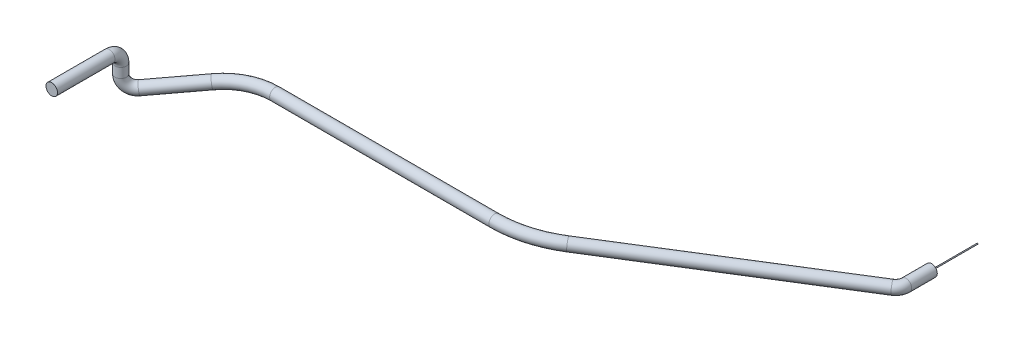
ISO-10303-21;
HEADER;
FILE_DESCRIPTION(('STEP AP214'),'2;1');
FILE_NAME('part.step','',(''),(''),'','','');
FILE_SCHEMA(('AUTOMOTIVE_DESIGN { 1 0 10303 214 1 1 1 1 }'));
ENDSEC;
DATA;
#1=APPLICATION_CONTEXT('core data for automotive mechanical design processes');
#2=APPLICATION_PROTOCOL_DEFINITION('international standard','automotive_design',2000,#1);
#3=PRODUCT_CONTEXT('',#1,'mechanical');
#4=PRODUCT('Part','Part','',(#3));
#5=PRODUCT_RELATED_PRODUCT_CATEGORY('part','',(#4));
#6=PRODUCT_DEFINITION_FORMATION('','',#4);
#7=PRODUCT_DEFINITION_CONTEXT('part definition',#1,'design');
#8=PRODUCT_DEFINITION('design','',#6,#7);
#9=PRODUCT_DEFINITION_SHAPE('','',#8);
#10=(LENGTH_UNIT() NAMED_UNIT(*) SI_UNIT(.MILLI.,.METRE.));
#11=(NAMED_UNIT(*) PLANE_ANGLE_UNIT() SI_UNIT($,.RADIAN.));
#12=(NAMED_UNIT(*) SI_UNIT($,.STERADIAN.) SOLID_ANGLE_UNIT());
#13=UNCERTAINTY_MEASURE_WITH_UNIT(LENGTH_MEASURE(1.E-05),#10,'distance_accuracy_value','');
#14=(GEOMETRIC_REPRESENTATION_CONTEXT(3) GLOBAL_UNCERTAINTY_ASSIGNED_CONTEXT((#13)) GLOBAL_UNIT_ASSIGNED_CONTEXT((#10,
#11,#12)) REPRESENTATION_CONTEXT('',''));
#15=CARTESIAN_POINT('',(0.,0.,0.));
#16=DIRECTION('',(0.,0.,1.));
#17=DIRECTION('',(1.,0.,0.));
#18=AXIS2_PLACEMENT_3D('',#15,#16,#17);
#19=CARTESIAN_POINT('',(60.579,-0.5715,0.));
#20=DIRECTION('',(0.,0.,1.));
#21=DIRECTION('',(1.,0.,0.));
#22=AXIS2_PLACEMENT_3D('',#19,#20,#21);
#23=PLANE('',#22);
#24=CARTESIAN_POINT('',(60.579,-0.5715,0.));
#25=DIRECTION('',(0.,0.,1.));
#26=DIRECTION('',(1.,0.,0.));
#27=AXIS2_PLACEMENT_3D('',#24,#25,#26);
#28=CIRCLE('',#27,1.5875);
#29=CARTESIAN_POINT('',(62.1665,-0.5715,0.));
#30=VERTEX_POINT('',#29);
#31=EDGE_CURVE('E70',#30,#30,#28,.T.);
#32=ORIENTED_EDGE('',*,*,#31,.F.);
#33=EDGE_LOOP('',(#32));
#34=FACE_BOUND('',#33,.T.);
#35=CARTESIAN_POINT('',(60.579,-0.5715,0.));
#36=DIRECTION('',(0.,0.,1.));
#37=DIRECTION('',(1.,0.,0.));
#38=AXIS2_PLACEMENT_3D('',#35,#36,#37);
#39=CIRCLE('',#38,0.127000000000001);
#40=CARTESIAN_POINT('',(60.706,-0.5715,0.));
#41=VERTEX_POINT('',#40);
#42=EDGE_CURVE('E10',#41,#41,#39,.F.);
#43=ORIENTED_EDGE('',*,*,#42,.F.);
#44=EDGE_LOOP('',(#43));
#45=FACE_BOUND('',#44,.T.);
#46=ADVANCED_FACE('F26',(#34,#45),#23,.F.);
#47=CARTESIAN_POINT('',(-94.0247976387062,9.52500000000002,72.413791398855));
#48=DIRECTION('',(0.,0.,1.));
#49=DIRECTION('',(0.,-1.,0.));
#50=AXIS2_PLACEMENT_3D('',#47,#48,#49);
#51=CYLINDRICAL_SURFACE('',#50,1.5875);
#52=CARTESIAN_POINT('',(-94.0247976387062,9.52500000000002,72.413791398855));
#53=DIRECTION('',(0.,0.,1.));
#54=DIRECTION('',(0.730796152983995,-0.682595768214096,0.));
#55=AXIS2_PLACEMENT_3D('',#52,#53,#54);
#56=CIRCLE('',#55,1.5875);
#57=CARTESIAN_POINT('',(-94.0247976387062,11.1125,72.413791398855));
#58=VERTEX_POINT('',#57);
#59=EDGE_CURVE('E37',#58,#58,#56,.T.);
#60=ORIENTED_EDGE('',*,*,#59,.T.);
#61=EDGE_LOOP('',(#60));
#62=FACE_BOUND('',#61,.T.);
#63=CARTESIAN_POINT('',(-94.0247976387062,9.52500000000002,88.288791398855));
#64=DIRECTION('',(0.,0.,1.));
#65=DIRECTION('',(0.730796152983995,-0.682595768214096,0.));
#66=AXIS2_PLACEMENT_3D('',#63,#64,#65);
#67=CIRCLE('',#66,1.5875);
#68=CARTESIAN_POINT('',(-92.8646587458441,8.44137921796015,88.288791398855));
#69=VERTEX_POINT('',#68);
#70=EDGE_CURVE('E33',#69,#69,#67,.T.);
#71=ORIENTED_EDGE('',*,*,#70,.F.);
#72=EDGE_LOOP('',(#71));
#73=FACE_BOUND('',#72,.T.);
#74=ADVANCED_FACE('F28',(#62,#73),#51,.T.);
#75=CARTESIAN_POINT('',(-94.0247976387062,6.35000000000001,72.413791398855));
#76=DIRECTION('',(1.,0.,0.));
#77=DIRECTION('',(0.,0.,-1.));
#78=AXIS2_PLACEMENT_3D('',#75,#76,#77);
#79=TOROIDAL_SURFACE('',#78,3.175,1.5875);
#80=CARTESIAN_POINT('',(-94.0247976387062,6.35000000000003,69.238791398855));
#81=DIRECTION('',(0.,1.,0.));
#82=DIRECTION('',(0.730796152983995,0.,0.682595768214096));
#83=AXIS2_PLACEMENT_3D('',#80,#81,#82);
#84=CIRCLE('',#83,1.5875);
#85=CARTESIAN_POINT('',(-94.0247976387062,6.35000000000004,67.651291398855));
#86=VERTEX_POINT('',#85);
#87=EDGE_CURVE('E41',#86,#86,#84,.T.);
#88=CARTESIAN_POINT('',(-94.0247976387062,6.35000000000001,72.413791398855));
#89=DIRECTION('',(1.,0.,0.));
#90=DIRECTION('',(0.,0.,-1.));
#91=AXIS2_PLACEMENT_3D('',#88,#89,#90);
#92=CIRCLE('',#91,4.7625);
#93=EDGE_CURVE('',#86,#58,#92,.T.);
#94=ORIENTED_EDGE('',*,*,#87,.T.);
#95=ORIENTED_EDGE('',*,*,#59,.F.);
#96=ORIENTED_EDGE('',*,*,#93,.T.);
#97=ORIENTED_EDGE('',*,*,#93,.F.);
#98=EDGE_LOOP('',(#94,#96,#95,#97));
#99=FACE_BOUND('',#98,.T.);
#100=ADVANCED_FACE('F96',(#99),#79,.T.);
#101=CARTESIAN_POINT('',(-94.0247976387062,3.6867837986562,69.2387913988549));
#102=DIRECTION('',(0.,1.,0.));
#103=DIRECTION('',(0.,0.,1.));
#104=AXIS2_PLACEMENT_3D('',#101,#102,#103);
#105=CYLINDRICAL_SURFACE('',#104,1.5875);
#106=CARTESIAN_POINT('',(-94.0247976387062,3.6867837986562,69.2387913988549));
#107=DIRECTION('',(0.,1.,0.));
#108=DIRECTION('',(0.730796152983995,0.,0.682595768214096));
#109=AXIS2_PLACEMENT_3D('',#106,#107,#108);
#110=CIRCLE('',#109,1.5875);
#111=CARTESIAN_POINT('',(-95.2235697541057,3.68678379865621,70.2795131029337));
#112=VERTEX_POINT('',#111);
#113=EDGE_CURVE('E46',#112,#112,#110,.T.);
#114=ORIENTED_EDGE('',*,*,#113,.T.);
#115=EDGE_LOOP('',(#114));
#116=FACE_BOUND('',#115,.T.);
#117=ORIENTED_EDGE('',*,*,#87,.F.);
#118=EDGE_LOOP('',(#117));
#119=FACE_BOUND('',#118,.T.);
#120=ADVANCED_FACE('F131',(#116,#119),#105,.T.);
#121=CARTESIAN_POINT('',(-91.6272534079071,3.68678379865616,67.1573479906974));
#122=DIRECTION('',(-0.655572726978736,0.,-0.755132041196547));
#123=DIRECTION('',(-0.755132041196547,0.,0.655572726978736));
#124=AXIS2_PLACEMENT_3D('',#121,#122,#123);
#125=TOROIDAL_SURFACE('',#124,3.17500000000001,1.5875);
#126=CARTESIAN_POINT('',(-91.2715918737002,0.546912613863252,66.848578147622));
#127=DIRECTION('',(-0.74677711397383,-0.148344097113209,0.648319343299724));
#128=DIRECTION('',(0.640303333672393,0.103201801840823,0.761157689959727));
#129=AXIS2_PLACEMENT_3D('',#126,#127,#128);
#130=CIRCLE('',#129,1.5875);
#131=CARTESIAN_POINT('',(-91.0937611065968,-1.0230229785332,66.6941932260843));
#132=VERTEX_POINT('',#131);
#133=EDGE_CURVE('E49',#132,#132,#130,.T.);
#134=CARTESIAN_POINT('',(-91.6272534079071,3.68678379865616,67.1573479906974));
#135=DIRECTION('',(-0.655572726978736,0.,-0.755132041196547));
#136=DIRECTION('',(-0.755132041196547,0.,0.655572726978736));
#137=AXIS2_PLACEMENT_3D('',#134,#135,#136);
#138=CIRCLE('',#137,4.7625);
#139=EDGE_CURVE('',#132,#112,#138,.T.);
#140=ORIENTED_EDGE('',*,*,#133,.T.);
#141=ORIENTED_EDGE('',*,*,#113,.F.);
#142=ORIENTED_EDGE('',*,*,#139,.T.);
#143=ORIENTED_EDGE('',*,*,#139,.F.);
#144=EDGE_LOOP('',(#140,#142,#141,#143));
#145=FACE_BOUND('',#144,.T.);
#146=ADVANCED_FACE('F127',(#145),#125,.T.);
#147=CARTESIAN_POINT('',(-80.473158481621,2.69197547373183,57.4738489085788));
#148=DIRECTION('',(-0.746777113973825,-0.148344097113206,0.648319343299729));
#149=DIRECTION('',(0.655572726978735,0.,0.755132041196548));
#150=AXIS2_PLACEMENT_3D('',#147,#148,#149);
#151=CYLINDRICAL_SURFACE('',#150,1.5875);
#152=CARTESIAN_POINT('',(-80.473158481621,2.69197547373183,57.4738489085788));
#153=DIRECTION('',(-0.74677711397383,-0.148344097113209,0.648319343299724));
#154=DIRECTION('',(0.640303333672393,0.103201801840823,0.761157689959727));
#155=AXIS2_PLACEMENT_3D('',#152,#153,#154);
#156=CIRCLE('',#155,1.5875);
#157=CARTESIAN_POINT('',(-81.5289640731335,2.95640185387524,56.3182064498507));
#158=VERTEX_POINT('',#157);
#159=EDGE_CURVE('E52',#158,#158,#156,.T.);
#160=ORIENTED_EDGE('',*,*,#159,.T.);
#161=EDGE_LOOP('',(#160));
#162=FACE_BOUND('',#161,.T.);
#163=ORIENTED_EDGE('',*,*,#133,.F.);
#164=EDGE_LOOP('',(#163));
#165=FACE_BOUND('',#164,.T.);
#166=ADVANCED_FACE('F123',(#162,#165),#151,.T.);
#167=CARTESIAN_POINT('',(-67.8034913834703,-0.481141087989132,71.3415584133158));
#168=DIRECTION('',(0.,0.974807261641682,0.223048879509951));
#169=DIRECTION('',(0.,-0.223048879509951,0.974807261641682));
#170=AXIS2_PLACEMENT_3D('',#167,#168,#169);
#171=TOROIDAL_SURFACE('',#170,19.05,1.5875);
#172=CARTESIAN_POINT('',(-67.8034913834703,3.76794006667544,52.7714800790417));
#173=DIRECTION('',(-1.,0.,0.));
#174=DIRECTION('',(0.,0.0488243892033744,0.998807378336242));
#175=AXIS2_PLACEMENT_3D('',#172,#173,#174);
#176=CIRCLE('',#175,1.5875);
#177=CARTESIAN_POINT('',(-67.8034913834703,4.12203016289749,51.2239735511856));
#178=VERTEX_POINT('',#177);
#179=EDGE_CURVE('E55',#178,#178,#176,.T.);
#180=CARTESIAN_POINT('',(-67.8034913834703,-0.481141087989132,71.3415584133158));
#181=DIRECTION('',(0.,0.974807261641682,0.223048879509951));
#182=DIRECTION('',(0.,-0.223048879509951,0.974807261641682));
#183=AXIS2_PLACEMENT_3D('',#180,#181,#182);
#184=CIRCLE('',#183,20.6375);
#185=EDGE_CURVE('',#178,#158,#184,.T.);
#186=ORIENTED_EDGE('',*,*,#179,.T.);
#187=ORIENTED_EDGE('',*,*,#159,.F.);
#188=ORIENTED_EDGE('',*,*,#185,.T.);
#189=ORIENTED_EDGE('',*,*,#185,.F.);
#190=EDGE_LOOP('',(#186,#188,#187,#189));
#191=FACE_BOUND('',#190,.T.);
#192=ADVANCED_FACE('F119',(#191),#171,.T.);
#193=CARTESIAN_POINT('',(-7.2636235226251,3.76794006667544,52.7714800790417));
#194=DIRECTION('',(-1.,0.,0.));
#195=DIRECTION('',(0.,0.,1.));
#196=AXIS2_PLACEMENT_3D('',#193,#194,#195);
#197=CYLINDRICAL_SURFACE('',#196,1.5875);
#198=CARTESIAN_POINT('',(-7.2636235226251,3.76794006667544,52.7714800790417));
#199=DIRECTION('',(-1.,0.,0.));
#200=DIRECTION('',(0.,0.0488243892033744,0.998807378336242));
#201=AXIS2_PLACEMENT_3D('',#198,#199,#200);
#202=CIRCLE('',#201,1.5875);
#203=CARTESIAN_POINT('',(-7.2636235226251,3.9233489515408,54.3513548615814));
#204=VERTEX_POINT('',#203);
#205=EDGE_CURVE('E58',#204,#204,#202,.T.);
#206=ORIENTED_EDGE('',*,*,#205,.T.);
#207=EDGE_LOOP('',(#206));
#208=FACE_BOUND('',#207,.T.);
#209=ORIENTED_EDGE('',*,*,#179,.F.);
#210=EDGE_LOOP('',(#209));
#211=FACE_BOUND('',#210,.T.);
#212=ADVANCED_FACE('F115',(#208,#211),#197,.T.);
#213=CARTESIAN_POINT('',(-7.26362352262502,1.28139790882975,27.4934835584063));
#214=DIRECTION('',(0.,-0.995196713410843,0.097895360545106));
#215=DIRECTION('',(0.,-0.097895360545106,-0.995196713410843));
#216=AXIS2_PLACEMENT_3D('',#213,#214,#215);
#217=TOROIDAL_SURFACE('',#216,25.4,1.5875);
#218=CARTESIAN_POINT('',(7.92566735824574,3.27434511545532,47.7536317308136));
#219=DIRECTION('',(-0.801493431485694,0.0585417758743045,0.595131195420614));
#220=DIRECTION('',(0.597279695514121,0.0294150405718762,0.801493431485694));
#221=AXIS2_PLACEMENT_3D('',#218,#219,#220);
#222=CIRCLE('',#221,1.5875);
#223=CARTESIAN_POINT('',(8.87499803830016,3.39890431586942,49.019890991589));
#224=VERTEX_POINT('',#223);
#225=EDGE_CURVE('E61',#224,#224,#222,.T.);
#226=CARTESIAN_POINT('',(-7.26362352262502,1.28139790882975,27.4934835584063));
#227=DIRECTION('',(0.,-0.995196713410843,0.097895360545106));
#228=DIRECTION('',(0.,-0.097895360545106,-0.995196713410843));
#229=AXIS2_PLACEMENT_3D('',#226,#227,#228);
#230=CIRCLE('',#229,26.9875);
#231=EDGE_CURVE('',#224,#204,#230,.T.);
#232=ORIENTED_EDGE('',*,*,#225,.T.);
#233=ORIENTED_EDGE('',*,*,#205,.F.);
#234=ORIENTED_EDGE('',*,*,#231,.T.);
#235=ORIENTED_EDGE('',*,*,#231,.F.);
#236=EDGE_LOOP('',(#232,#234,#233,#235));
#237=FACE_BOUND('',#236,.T.);
#238=ADVANCED_FACE('F111',(#237),#217,.T.);
#239=CARTESIAN_POINT('',(59.2969568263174,-0.477858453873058,9.60901854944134));
#240=DIRECTION('',(-0.801493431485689,0.0585417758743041,0.595131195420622));
#241=DIRECTION('',(0.596153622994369,0.,0.80287038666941));
#242=AXIS2_PLACEMENT_3D('',#239,#240,#241);
#243=CYLINDRICAL_SURFACE('',#242,1.5875);
#244=CARTESIAN_POINT('',(59.2969568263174,-0.477858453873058,9.60901854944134));
#245=DIRECTION('',(-0.801493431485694,0.0585417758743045,0.595131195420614));
#246=DIRECTION('',(0.597279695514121,0.0294150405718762,0.801493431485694));
#247=AXIS2_PLACEMENT_3D('',#244,#245,#246);
#248=CIRCLE('',#247,1.5875);
#249=CARTESIAN_POINT('',(60.2392174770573,-0.546681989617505,10.8847788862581));
#250=VERTEX_POINT('',#249);
#251=EDGE_CURVE('E64',#250,#250,#248,.T.);
#252=ORIENTED_EDGE('',*,*,#251,.T.);
#253=EDGE_LOOP('',(#252));
#254=FACE_BOUND('',#253,.T.);
#255=ORIENTED_EDGE('',*,*,#225,.F.);
#256=EDGE_LOOP('',(#255));
#257=FACE_BOUND('',#256,.T.);
#258=ADVANCED_FACE('F107',(#254,#257),#243,.T.);
#259=CARTESIAN_POINT('',(57.4124355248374,-0.340211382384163,7.05749787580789));
#260=DIRECTION('',(-0.0728468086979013,-0.997343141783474,0.));
#261=DIRECTION('',(0.997343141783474,-0.0728468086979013,0.));
#262=AXIS2_PLACEMENT_3D('',#259,#260,#261);
#263=TOROIDAL_SURFACE('',#262,3.175,1.5875);
#264=CARTESIAN_POINT('',(60.579,-0.5715,7.05749787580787));
#265=DIRECTION('',(0.,0.,1.));
#266=DIRECTION('',(1.,0.,0.));
#267=AXIS2_PLACEMENT_3D('',#264,#265,#266);
#268=CIRCLE('',#267,1.5875);
#269=CARTESIAN_POINT('',(62.1622822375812,-0.687144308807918,7.05749787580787));
#270=VERTEX_POINT('',#269);
#271=EDGE_CURVE('E67',#270,#270,#268,.T.);
#272=CARTESIAN_POINT('',(57.4124355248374,-0.340211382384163,7.05749787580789));
#273=DIRECTION('',(-0.0728468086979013,-0.997343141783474,0.));
#274=DIRECTION('',(0.997343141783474,-0.0728468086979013,0.));
#275=AXIS2_PLACEMENT_3D('',#272,#273,#274);
#276=CIRCLE('',#275,4.7625);
#277=EDGE_CURVE('',#270,#250,#276,.T.);
#278=ORIENTED_EDGE('',*,*,#271,.T.);
#279=ORIENTED_EDGE('',*,*,#251,.F.);
#280=ORIENTED_EDGE('',*,*,#277,.T.);
#281=ORIENTED_EDGE('',*,*,#277,.F.);
#282=EDGE_LOOP('',(#278,#280,#279,#281));
#283=FACE_BOUND('',#282,.T.);
#284=ADVANCED_FACE('F103',(#283),#263,.T.);
#285=CARTESIAN_POINT('',(60.579,-0.5715,7.05749787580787));
#286=DIRECTION('',(0.,0.,-1.));
#287=DIRECTION('',(0.,1.,0.));
#288=AXIS2_PLACEMENT_3D('',#285,#286,#287);
#289=CYLINDRICAL_SURFACE('',#288,1.5875);
#290=ORIENTED_EDGE('',*,*,#271,.F.);
#291=EDGE_LOOP('',(#290));
#292=FACE_BOUND('',#291,.T.);
#293=ORIENTED_EDGE('',*,*,#31,.T.);
#294=EDGE_LOOP('',(#293));
#295=FACE_BOUND('',#294,.T.);
#296=ADVANCED_FACE('F89',(#292,#295),#289,.T.);
#297=CARTESIAN_POINT('',(-94.0247976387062,9.52500000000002,88.288791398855));
#298=DIRECTION('',(0.,0.,1.));
#299=DIRECTION('',(0.730796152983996,-0.682595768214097,0.));
#300=AXIS2_PLACEMENT_3D('',#297,#298,#299);
#301=PLANE('',#300);
#302=ORIENTED_EDGE('',*,*,#70,.T.);
#303=EDGE_LOOP('',(#302));
#304=FACE_BOUND('',#303,.T.);
#305=ADVANCED_FACE('F81',(#304),#301,.T.);
#306=CARTESIAN_POINT('',(60.579,-0.5715,-12.7));
#307=DIRECTION('',(0.,0.,1.));
#308=DIRECTION('',(1.,0.,0.));
#309=AXIS2_PLACEMENT_3D('',#306,#307,#308);
#310=CYLINDRICAL_SURFACE('',#309,0.127000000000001);
#311=CARTESIAN_POINT('',(60.579,-0.5715,-12.7));
#312=DIRECTION('',(0.,0.,-1.));
#313=DIRECTION('',(-1.,0.,0.));
#314=AXIS2_PLACEMENT_3D('',#311,#312,#313);
#315=CIRCLE('',#314,0.127000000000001);
#316=CARTESIAN_POINT('',(60.452,-0.5715,-12.7));
#317=VERTEX_POINT('',#316);
#318=EDGE_CURVE('E73',#317,#317,#315,.T.);
#319=ORIENTED_EDGE('',*,*,#318,.F.);
#320=EDGE_LOOP('',(#319));
#321=FACE_BOUND('',#320,.T.);
#322=ORIENTED_EDGE('',*,*,#42,.T.);
#323=EDGE_LOOP('',(#322));
#324=FACE_BOUND('',#323,.T.);
#325=ADVANCED_FACE('F79',(#321,#324),#310,.T.);
#326=CARTESIAN_POINT('',(60.579,-0.5715,-12.7));
#327=DIRECTION('',(0.,0.,-1.));
#328=DIRECTION('',(-1.,0.,0.));
#329=AXIS2_PLACEMENT_3D('',#326,#327,#328);
#330=PLANE('',#329);
#331=ORIENTED_EDGE('',*,*,#318,.T.);
#332=EDGE_LOOP('',(#331));
#333=FACE_BOUND('',#332,.T.);
#334=ADVANCED_FACE('F77',(#333),#330,.T.);
#335=CLOSED_SHELL('',(#46,#74,#100,#120,#146,#166,#192,#212,#238,#258,#284,#296,#305,#325,#334));
#336=MANIFOLD_SOLID_BREP('B2',#335);
#337=ADVANCED_BREP_SHAPE_REPRESENTATION('',(#18,#336),#14);
#338=SHAPE_DEFINITION_REPRESENTATION(#9,#337);
ENDSEC;
END-ISO-10303-21;
